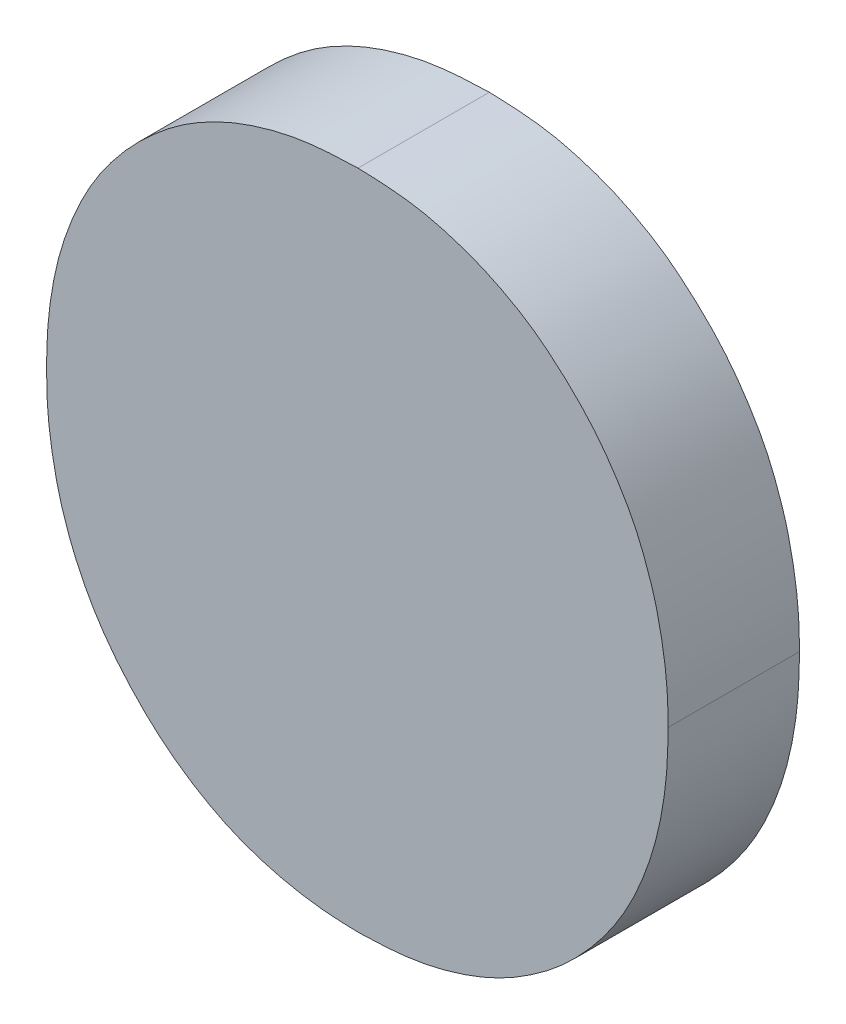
ISO-10303-21;
HEADER;
FILE_DESCRIPTION(('STEP AP214'),'2;1');
FILE_NAME('part.step','',(''),(''),'','','');
FILE_SCHEMA(('AUTOMOTIVE_DESIGN { 1 0 10303 214 1 1 1 1 }'));
ENDSEC;
DATA;
#1=APPLICATION_CONTEXT('core data for automotive mechanical design processes');
#2=APPLICATION_PROTOCOL_DEFINITION('international standard','automotive_design',2000,#1);
#3=PRODUCT_CONTEXT('',#1,'mechanical');
#4=PRODUCT('Part','Part','',(#3));
#5=PRODUCT_RELATED_PRODUCT_CATEGORY('part','',(#4));
#6=PRODUCT_DEFINITION_FORMATION('','',#4);
#7=PRODUCT_DEFINITION_CONTEXT('part definition',#1,'design');
#8=PRODUCT_DEFINITION('design','',#6,#7);
#9=PRODUCT_DEFINITION_SHAPE('','',#8);
#10=(LENGTH_UNIT() NAMED_UNIT(*) SI_UNIT(.MILLI.,.METRE.));
#11=(NAMED_UNIT(*) PLANE_ANGLE_UNIT() SI_UNIT($,.RADIAN.));
#12=(NAMED_UNIT(*) SI_UNIT($,.STERADIAN.) SOLID_ANGLE_UNIT());
#13=UNCERTAINTY_MEASURE_WITH_UNIT(LENGTH_MEASURE(1.E-05),#10,'distance_accuracy_value','');
#14=(GEOMETRIC_REPRESENTATION_CONTEXT(3) GLOBAL_UNCERTAINTY_ASSIGNED_CONTEXT((#13)) GLOBAL_UNIT_ASSIGNED_CONTEXT((#10,
#11,#12)) REPRESENTATION_CONTEXT('',''));
#15=CARTESIAN_POINT('',(0.,0.,0.));
#16=DIRECTION('',(0.,0.,1.));
#17=DIRECTION('',(1.,0.,0.));
#18=AXIS2_PLACEMENT_3D('',#15,#16,#17);
#19=CARTESIAN_POINT('',(0.,0.,0.));
#20=DIRECTION('',(0.,0.,1.));
#21=DIRECTION('',(1.,0.,0.));
#22=AXIS2_PLACEMENT_3D('',#19,#20,#21);
#23=PLANE('',#22);
#24=CARTESIAN_POINT('',(100.448005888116,202.591844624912,0.));
#25=CARTESIAN_POINT('',(100.447479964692,202.625700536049,0.));
#26=CARTESIAN_POINT('',(100.44698122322,202.659588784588,0.));
#27=CARTESIAN_POINT('',(100.445034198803,202.727310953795,0.));
#28=CARTESIAN_POINT('',(100.443586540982,202.76114489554,0.));
#29=CARTESIAN_POINT('',(100.438732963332,202.828778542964,0.));
#30=CARTESIAN_POINT('',(100.435321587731,202.862577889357,0.));
#31=CARTESIAN_POINT('',(100.42684795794,202.929969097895,0.));
#32=CARTESIAN_POINT('',(100.421785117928,202.963560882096,0.));
#33=CARTESIAN_POINT('',(100.410525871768,203.030511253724,0.));
#34=CARTESIAN_POINT('',(100.404330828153,203.063870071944,0.));
#35=CARTESIAN_POINT('',(100.390513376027,203.130284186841,0.));
#36=CARTESIAN_POINT('',(100.382891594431,203.163339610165,0.));
#37=CARTESIAN_POINT('',(100.365797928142,203.228933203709,0.));
#38=CARTESIAN_POINT('',(100.356328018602,203.261471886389,0.));
#39=CARTESIAN_POINT('',(100.335801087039,203.326055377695,0.));
#40=CARTESIAN_POINT('',(100.3247432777,203.35809993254,0.));
#41=CARTESIAN_POINT('',(100.304085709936,203.414307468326,0.));
#42=CARTESIAN_POINT('',(100.294746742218,203.43856680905,0.));
#43=CARTESIAN_POINT('',(100.275095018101,203.486677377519,0.));
#44=CARTESIAN_POINT('',(100.264782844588,203.510528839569,0.));
#45=CARTESIAN_POINT('',(100.242881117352,203.557652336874,0.));
#46=CARTESIAN_POINT('',(100.23129109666,203.580924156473,0.));
#47=CARTESIAN_POINT('',(100.206896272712,203.626829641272,0.));
#48=CARTESIAN_POINT('',(100.194090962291,203.649463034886,0.));
#49=CARTESIAN_POINT('',(100.167646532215,203.694181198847,0.));
#50=CARTESIAN_POINT('',(100.154008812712,203.716266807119,0.));
#51=CARTESIAN_POINT('',(100.126100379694,203.760031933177,0.));
#52=CARTESIAN_POINT('',(100.11182972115,203.781711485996,0.));
#53=CARTESIAN_POINT('',(100.082482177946,203.824521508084,0.));
#54=CARTESIAN_POINT('',(100.067405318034,203.845651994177,0.));
#55=CARTESIAN_POINT('',(100.036285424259,203.887187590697,0.));
#56=CARTESIAN_POINT('',(100.020242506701,203.907592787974,0.));
#57=CARTESIAN_POINT('',(99.9872391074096,203.947605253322,0.));
#58=CARTESIAN_POINT('',(99.9702797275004,203.967213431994,0.));
#59=CARTESIAN_POINT('',(99.9355341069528,204.005682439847,0.));
#60=CARTESIAN_POINT('',(99.9177478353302,204.024543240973,0.));
#61=CARTESIAN_POINT('',(99.8814361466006,204.061541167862,0.));
#62=CARTESIAN_POINT('',(99.862910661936,204.079678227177,0.));
#63=CARTESIAN_POINT('',(99.8252323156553,204.115294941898,0.));
#64=CARTESIAN_POINT('',(99.8060792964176,204.132774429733,0.));
#65=CARTESIAN_POINT('',(99.7672915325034,204.167182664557,0.));
#66=CARTESIAN_POINT('',(99.7476568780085,204.184111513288,0.));
#67=CARTESIAN_POINT('',(99.7077835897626,204.217229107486,0.));
#68=CARTESIAN_POINT('',(99.6875452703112,204.233418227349,0.));
#69=CARTESIAN_POINT('',(99.6462100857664,204.264702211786,0.));
#70=CARTESIAN_POINT('',(99.6251126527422,204.279796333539,0.));
#71=CARTESIAN_POINT('',(99.5820407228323,204.308699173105,0.));
#72=CARTESIAN_POINT('',(99.5600657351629,204.322507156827,0.));
#73=CARTESIAN_POINT('',(99.5158341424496,204.34891705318,0.));
#74=CARTESIAN_POINT('',(99.4935860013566,204.361533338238,0.));
#75=CARTESIAN_POINT('',(99.448675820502,204.386013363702,0.));
#76=CARTESIAN_POINT('',(99.4260137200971,204.39787699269,0.));
#77=CARTESIAN_POINT('',(99.3802171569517,204.420701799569,0.));
#78=CARTESIAN_POINT('',(99.3570824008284,204.4316623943,0.));
#79=CARTESIAN_POINT('',(99.3103046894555,204.452424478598,0.));
#80=CARTESIAN_POINT('',(99.2866618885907,204.462226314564,0.));
#81=CARTESIAN_POINT('',(99.2389394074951,204.480668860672,0.));
#82=CARTESIAN_POINT('',(99.2148598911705,204.489309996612,0.));
#83=CARTESIAN_POINT('',(99.1663873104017,204.505671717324,0.));
#84=CARTESIAN_POINT('',(99.1419941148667,204.513391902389,0.));
#85=CARTESIAN_POINT('',(99.0684837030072,204.535339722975,0.));
#86=CARTESIAN_POINT('',(99.0189807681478,204.548375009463,0.));
#87=CARTESIAN_POINT('',(98.9520694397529,204.562230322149,0.));
#88=CARTESIAN_POINT('',(98.9351486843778,204.565418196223,0.));
#89=CARTESIAN_POINT('',(98.9012083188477,204.571191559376,0.));
#90=CARTESIAN_POINT('',(98.8841887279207,204.57377716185,0.));
#91=CARTESIAN_POINT('',(98.8500933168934,204.578419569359,0.));
#92=CARTESIAN_POINT('',(98.8330175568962,204.580476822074,0.));
#93=CARTESIAN_POINT('',(98.7988152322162,204.584125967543,0.));
#94=CARTESIAN_POINT('',(98.7816886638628,204.585717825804,0.));
#95=CARTESIAN_POINT('',(98.7303638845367,204.589874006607,0.));
#96=CARTESIAN_POINT('',(98.6961193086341,204.591831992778,0.));
#97=CARTESIAN_POINT('',(98.6275870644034,204.594931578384,0.));
#98=CARTESIAN_POINT('',(98.5932993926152,204.59607310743,0.));
#99=CARTESIAN_POINT('',(98.559033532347,204.597208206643,0.));
#100=B_SPLINE_CURVE_WITH_KNOTS('',3,(#24,#25,#26,#27,#28,#29,#30,#31,#32,#33,#34,#35,#36,#37,
#38,#39,#40,#41,#42,#43,#44,#45,#46,#47,#48,#49,#50,#51,#52,#53,#54,#55,#56,#57,#58,#59,#60,#61,
#62,#63,#64,#65,#66,#67,#68,#69,#70,#71,#72,#73,#74,#75,#76,#77,#78,#79,#80,#81,#82,#83,#84,#85,
#86,#87,#88,#89,#90,#91,#92,#93,#94,#95,#96,#97,#98,#99),.UNSPECIFIED.,.F.,.F.,(4,2,2,2,2,2,2,2,
2,2,2,2,2,2,2,2,2,2,2,2,2,2,2,2,2,2,2,2,2,2,2,2,2,2,2,2,2,4),(0.,0.101636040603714,
0.203205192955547,0.305057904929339,0.406946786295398,0.508713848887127,0.610436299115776,
0.712050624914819,0.813715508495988,0.89168699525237,0.969612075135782,1.04756572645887,
1.12555205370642,1.20341063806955,1.28126247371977,1.35911192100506,1.43695201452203,
1.51470052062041,1.59245194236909,1.67021048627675,1.74798871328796,1.82575248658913,
1.90347645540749,1.98125266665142,2.05907300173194,2.13578537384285,2.21250907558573,
2.28928194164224,2.36603179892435,2.44275342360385,2.51950822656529,2.67284232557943,
2.72448683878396,2.77612162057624,2.8277125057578,2.87930721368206,2.98219065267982,
3.08508296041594),.UNSPECIFIED.);
#101=CARTESIAN_POINT('',(100.448005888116,202.591844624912,0.));
#102=VERTEX_POINT('',#101);
#103=CARTESIAN_POINT('',(98.559033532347,204.597208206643,0.));
#104=VERTEX_POINT('',#103);
#105=EDGE_CURVE('E24',#102,#104,#100,.T.);
#106=ORIENTED_EDGE('',*,*,#105,.F.);
#107=CARTESIAN_POINT('',(98.5647576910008,200.567400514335,0.));
#108=CARTESIAN_POINT('',(98.5988055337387,200.568475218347,0.));
#109=CARTESIAN_POINT('',(98.6328748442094,200.569558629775,0.));
#110=CARTESIAN_POINT('',(98.7010261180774,200.572569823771,0.));
#111=CARTESIAN_POINT('',(98.7351080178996,200.574498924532,0.));
#112=CARTESIAN_POINT('',(98.8032558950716,200.580039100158,0.));
#113=CARTESIAN_POINT('',(98.8373214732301,200.583655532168,0.));
#114=CARTESIAN_POINT('',(98.9051737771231,200.592805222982,0.));
#115=CARTESIAN_POINT('',(98.9389606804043,200.598337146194,0.));
#116=CARTESIAN_POINT('',(99.0058763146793,200.611459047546,0.));
#117=CARTESIAN_POINT('',(99.039008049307,200.619033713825,0.));
#118=CARTESIAN_POINT('',(99.1048145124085,200.636004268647,0.));
#119=CARTESIAN_POINT('',(99.137489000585,200.645401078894,0.));
#120=CARTESIAN_POINT('',(99.2022361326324,200.665902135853,0.));
#121=CARTESIAN_POINT('',(99.2343097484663,200.677003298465,0.));
#122=CARTESIAN_POINT('',(99.2977528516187,200.701031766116,0.));
#123=CARTESIAN_POINT('',(99.3291225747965,200.713958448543,0.));
#124=CARTESIAN_POINT('',(99.4051160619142,200.748055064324,0.));
#125=CARTESIAN_POINT('',(99.4492677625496,200.770297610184,0.));
#126=CARTESIAN_POINT('',(99.5352555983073,200.818891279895,0.));
#127=CARTESIAN_POINT('',(99.5770906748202,200.845244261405,0.));
#128=CARTESIAN_POINT('',(99.6383550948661,200.886905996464,0.));
#129=CARTESIAN_POINT('',(99.6585292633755,200.901149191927,0.));
#130=CARTESIAN_POINT('',(99.6983196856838,200.930394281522,0.));
#131=CARTESIAN_POINT('',(99.7179360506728,200.945396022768,0.));
#132=CARTESIAN_POINT('',(99.7564792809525,200.976252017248,0.));
#133=CARTESIAN_POINT('',(99.7754063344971,200.992106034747,0.));
#134=CARTESIAN_POINT('',(99.8124951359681,201.024687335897,0.));
#135=CARTESIAN_POINT('',(99.8306568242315,201.0414146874,0.));
#136=CARTESIAN_POINT('',(99.8662019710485,201.075552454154,0.));
#137=CARTESIAN_POINT('',(99.8835879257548,201.092960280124,0.));
#138=CARTESIAN_POINT('',(99.9177023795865,201.128407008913,0.));
#139=CARTESIAN_POINT('',(99.9344308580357,201.146445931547,0.));
#140=CARTESIAN_POINT('',(99.9836217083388,201.201477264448,0.));
#141=CARTESIAN_POINT('',(100.015081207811,201.239376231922,0.));
#142=CARTESIAN_POINT('',(100.074993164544,201.317461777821,0.));
#143=CARTESIAN_POINT('',(100.103446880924,201.357647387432,0.));
#144=CARTESIAN_POINT('',(100.156811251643,201.440285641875,0.));
#145=CARTESIAN_POINT('',(100.181723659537,201.482737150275,0.));
#146=CARTESIAN_POINT('',(100.229391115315,201.572284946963,0.));
#147=CARTESIAN_POINT('',(100.251911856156,201.619505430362,0.));
#148=CARTESIAN_POINT('',(100.293162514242,201.715590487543,0.));
#149=CARTESIAN_POINT('',(100.311890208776,201.764456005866,0.));
#150=CARTESIAN_POINT('',(100.345795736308,201.863506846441,0.));
#151=CARTESIAN_POINT('',(100.360966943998,201.91369444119,0.));
#152=CARTESIAN_POINT('',(100.387362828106,202.015072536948,0.));
#153=CARTESIAN_POINT('',(100.398589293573,202.066262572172,0.));
#154=CARTESIAN_POINT('',(100.415304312,202.156915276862,0.));
#155=CARTESIAN_POINT('',(100.421523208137,202.196248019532,0.));
#156=CARTESIAN_POINT('',(100.431947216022,202.275195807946,0.));
#157=CARTESIAN_POINT('',(100.436152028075,202.314810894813,0.));
#158=CARTESIAN_POINT('',(100.442227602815,202.393990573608,0.));
#159=CARTESIAN_POINT('',(100.444110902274,202.433554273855,0.));
#160=CARTESIAN_POINT('',(100.446680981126,202.512705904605,0.));
#161=CARTESIAN_POINT('',(100.447368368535,202.552293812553,0.));
#162=CARTESIAN_POINT('',(100.448005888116,202.591844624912,0.));
#163=B_SPLINE_CURVE_WITH_KNOTS('',3,(#107,#108,#109,#110,#111,#112,#113,#114,#115,#116,#117,
#118,#119,#120,#121,#122,#123,#124,#125,#126,#127,#128,#129,#130,#131,#132,#133,#134,#135,#136,
#137,#138,#139,#140,#141,#142,#143,#144,#145,#146,#147,#148,#149,#150,#151,#152,#153,#154,#155,
#156,#157,#158,#159,#160,#161,#162),.UNSPECIFIED.,.F.,.F.,(4,2,2,2,2,2,2,2,2,2,2,2,2,2,2,2,2,2,
2,2,2,2,2,2,2,2,2,4),(0.,0.10223178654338,0.204623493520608,0.307342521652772,0.409990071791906,
0.511888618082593,0.613838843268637,0.715606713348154,0.817339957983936,0.965417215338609,
1.11356158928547,1.18763932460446,1.26170218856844,1.3357446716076,1.409792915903,
1.48358257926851,1.55737456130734,1.70499301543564,1.85254938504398,2.0000324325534,
2.15679342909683,2.31364602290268,2.47078853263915,2.62785968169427,2.74728336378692,
2.86672481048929,2.98551837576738,3.10425152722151),.UNSPECIFIED.);
#164=CARTESIAN_POINT('',(98.5647576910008,200.567400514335,0.));
#165=VERTEX_POINT('',#164);
#166=EDGE_CURVE('E69',#165,#102,#163,.T.);
#167=ORIENTED_EDGE('',*,*,#166,.F.);
#168=CARTESIAN_POINT('',(96.6624289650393,202.591844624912,0.));
#169=CARTESIAN_POINT('',(96.6627530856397,202.569292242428,0.));
#170=CARTESIAN_POINT('',(96.6630802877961,202.546737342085,0.));
#171=CARTESIAN_POINT('',(96.664004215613,202.501618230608,0.));
#172=CARTESIAN_POINT('',(96.6646011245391,202.479054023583,0.));
#173=CARTESIAN_POINT('',(96.6663298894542,202.43389604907,0.));
#174=CARTESIAN_POINT('',(96.6674628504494,202.411302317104,0.));
#175=CARTESIAN_POINT('',(96.6705706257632,202.366178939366,0.));
#176=CARTESIAN_POINT('',(96.6725451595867,202.343649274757,0.));
#177=CARTESIAN_POINT('',(96.6772838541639,202.298651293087,0.));
#178=CARTESIAN_POINT('',(96.6800488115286,202.276183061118,0.));
#179=CARTESIAN_POINT('',(96.6862405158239,202.231334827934,0.));
#180=CARTESIAN_POINT('',(96.6896674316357,202.208954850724,0.));
#181=CARTESIAN_POINT('',(96.700694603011,202.142062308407,0.));
#182=CARTESIAN_POINT('',(96.7090563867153,202.097669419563,0.));
#183=CARTESIAN_POINT('',(96.7235181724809,202.031511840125,0.));
#184=CARTESIAN_POINT('',(96.7286572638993,202.00953610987,0.));
#185=CARTESIAN_POINT('',(96.7396839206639,201.965772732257,0.));
#186=CARTESIAN_POINT('',(96.7455714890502,201.943985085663,0.));
#187=CARTESIAN_POINT('',(96.7643634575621,201.878959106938,0.));
#188=CARTESIAN_POINT('',(96.7784003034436,201.836042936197,0.));
#189=CARTESIAN_POINT('',(96.8125657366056,201.742641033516,0.));
#190=CARTESIAN_POINT('',(96.8333528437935,201.692396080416,0.));
#191=CARTESIAN_POINT('',(96.8790718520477,201.593836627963,0.));
#192=CARTESIAN_POINT('',(96.9040021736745,201.545521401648,0.));
#193=CARTESIAN_POINT('',(96.944582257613,201.47489065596,0.));
#194=CARTESIAN_POINT('',(96.9586413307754,201.451651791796,0.));
#195=CARTESIAN_POINT('',(96.9878366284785,201.405861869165,0.));
#196=CARTESIAN_POINT('',(97.0029727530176,201.38331074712,0.));
#197=CARTESIAN_POINT('',(97.0342566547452,201.338900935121,0.));
#198=CARTESIAN_POINT('',(97.0504050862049,201.317042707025,0.));
#199=CARTESIAN_POINT('',(97.0836479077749,201.274058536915,0.));
#200=CARTESIAN_POINT('',(97.1007422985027,201.25293259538,0.));
#201=CARTESIAN_POINT('',(97.1357451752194,201.211423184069,0.));
#202=CARTESIAN_POINT('',(97.1536523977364,201.191038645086,0.));
#203=CARTESIAN_POINT('',(97.1901713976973,201.150907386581,0.));
#204=CARTESIAN_POINT('',(97.2087832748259,201.131160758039,0.));
#205=CARTESIAN_POINT('',(97.2466821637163,201.092338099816,0.));
#206=CARTESIAN_POINT('',(97.265968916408,201.073261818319,0.));
#207=CARTESIAN_POINT('',(97.3053578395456,201.03597876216,0.));
#208=CARTESIAN_POINT('',(97.3254597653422,201.017771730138,0.));
#209=CARTESIAN_POINT('',(97.3870916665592,200.964772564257,0.));
#210=CARTESIAN_POINT('',(97.4299910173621,200.931556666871,0.));
#211=CARTESIAN_POINT('',(97.4962564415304,200.884487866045,0.));
#212=CARTESIAN_POINT('',(97.5186715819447,200.869253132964,0.));
#213=CARTESIAN_POINT('',(97.5641207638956,200.839739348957,0.));
#214=CARTESIAN_POINT('',(97.5871547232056,200.825460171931,0.));
#215=CARTESIAN_POINT('',(97.6573492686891,200.784172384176,0.));
#216=CARTESIAN_POINT('',(97.7054927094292,200.758792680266,0.));
#217=CARTESIAN_POINT('',(97.7793982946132,200.724430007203,0.));
#218=CARTESIAN_POINT('',(97.8043153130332,200.713593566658,0.));
#219=CARTESIAN_POINT('',(97.854664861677,200.693192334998,0.));
#220=CARTESIAN_POINT('',(97.8800973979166,200.683627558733,0.));
#221=CARTESIAN_POINT('',(97.9570932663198,200.656760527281,0.));
#222=CARTESIAN_POINT('',(98.009313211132,200.641304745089,0.));
#223=CARTESIAN_POINT('',(98.0884586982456,200.621529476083,0.));
#224=CARTESIAN_POINT('',(98.1149800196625,200.615505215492,0.));
#225=CARTESIAN_POINT('',(98.1682379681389,200.6044965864,0.));
#226=CARTESIAN_POINT('',(98.1949745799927,200.599512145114,0.));
#227=CARTESIAN_POINT('',(98.2501902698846,200.59036611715,0.));
#228=CARTESIAN_POINT('',(98.2786802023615,200.586269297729,0.));
#229=CARTESIAN_POINT('',(98.3215311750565,200.581138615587,0.));
#230=CARTESIAN_POINT('',(98.335832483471,200.579597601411,0.));
#231=CARTESIAN_POINT('',(98.364469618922,200.576878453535,0.));
#232=CARTESIAN_POINT('',(98.3788054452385,200.575700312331,0.));
#233=CARTESIAN_POINT('',(98.4217060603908,200.572644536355,0.));
#234=CARTESIAN_POINT('',(98.4503017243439,200.571229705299,0.));
#235=CARTESIAN_POINT('',(98.5075225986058,200.569012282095,0.));
#236=CARTESIAN_POINT('',(98.5361478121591,200.568209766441,0.));
#237=CARTESIAN_POINT('',(98.5647576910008,200.567400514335,0.));
#238=B_SPLINE_CURVE_WITH_KNOTS('',3,(#168,#169,#170,#171,#172,#173,#174,#175,#176,#177,#178,
#179,#180,#181,#182,#183,#184,#185,#186,#187,#188,#189,#190,#191,#192,#193,#194,#195,#196,#197,
#198,#199,#200,#201,#202,#203,#204,#205,#206,#207,#208,#209,#210,#211,#212,#213,#214,#215,#216,
#217,#218,#219,#220,#221,#222,#223,#224,#225,#226,#227,#228,#229,#230,#231,#232,#233,#234,#235,
#236,#237),.UNSPECIFIED.,.F.,.F.,(4,2,2,2,2,2,2,2,2,2,2,2,2,2,2,2,2,2,2,2,2,2,2,2,2,2,2,2,2,2,2,
2,2,2,4),(0.,0.0676683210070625,0.135382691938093,0.203237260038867,0.271069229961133,
0.338969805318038,0.406887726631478,0.542338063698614,0.610033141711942,0.677728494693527,
0.813073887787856,0.976015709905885,1.13889555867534,1.22035225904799,1.30180140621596,
1.38330374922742,1.46480614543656,1.54618592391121,1.62757725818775,1.7089376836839,
1.79027386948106,1.95275841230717,2.03405123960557,2.11533331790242,2.27830216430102,
2.35978713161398,2.44127305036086,2.6043818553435,2.68595785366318,2.76752814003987,
2.8538454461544,2.89699391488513,2.94014149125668,3.02602117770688,3.11191159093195),.UNSPECIFIED.);
#239=CARTESIAN_POINT('',(96.6624289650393,202.591844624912,0.));
#240=VERTEX_POINT('',#239);
#241=EDGE_CURVE('E82',#240,#165,#238,.T.);
#242=ORIENTED_EDGE('',*,*,#241,.F.);
#243=CARTESIAN_POINT('',(98.559033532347,204.597208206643,0.));
#244=CARTESIAN_POINT('',(98.5363353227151,204.596482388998,0.));
#245=CARTESIAN_POINT('',(98.5136349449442,204.595756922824,0.));
#246=CARTESIAN_POINT('',(98.4682274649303,204.594071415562,0.));
#247=CARTESIAN_POINT('',(98.4455203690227,204.59311121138,0.));
#248=CARTESIAN_POINT('',(98.4000700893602,204.590718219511,0.));
#249=CARTESIAN_POINT('',(98.3773269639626,204.589284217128,0.));
#250=CARTESIAN_POINT('',(98.3319028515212,204.585713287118,0.));
#251=CARTESIAN_POINT('',(98.3092218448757,204.583576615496,0.));
#252=CARTESIAN_POINT('',(98.263948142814,204.578522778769,0.));
#253=CARTESIAN_POINT('',(98.2413554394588,204.575605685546,0.));
#254=CARTESIAN_POINT('',(98.1962858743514,204.568900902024,0.));
#255=CARTESIAN_POINT('',(98.1738090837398,204.565112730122,0.));
#256=CARTESIAN_POINT('',(98.1181340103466,204.554532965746,0.));
#257=CARTESIAN_POINT('',(98.0850419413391,204.547176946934,0.));
#258=CARTESIAN_POINT('',(98.0192986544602,204.53067079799,0.));
#259=CARTESIAN_POINT('',(97.9866476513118,204.521519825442,0.));
#260=CARTESIAN_POINT('',(97.9218526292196,204.501565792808,0.));
#261=CARTESIAN_POINT('',(97.8897086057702,204.490762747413,0.));
#262=CARTESIAN_POINT('',(97.8261112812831,204.467314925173,0.));
#263=CARTESIAN_POINT('',(97.7946576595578,204.45467102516,0.));
#264=CARTESIAN_POINT('',(97.7406023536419,204.431027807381,0.));
#265=CARTESIAN_POINT('',(97.7178154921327,204.420449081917,0.));
#266=CARTESIAN_POINT('',(97.6727230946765,204.398330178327,0.));
#267=CARTESIAN_POINT('',(97.6504173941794,204.386790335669,0.));
#268=CARTESIAN_POINT('',(97.6063245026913,204.362778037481,0.));
#269=CARTESIAN_POINT('',(97.5845371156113,204.350305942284,0.));
#270=CARTESIAN_POINT('',(97.5415577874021,204.324374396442,0.));
#271=CARTESIAN_POINT('',(97.5203658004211,204.310915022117,0.));
#272=CARTESIAN_POINT('',(97.4786840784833,204.282939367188,0.));
#273=CARTESIAN_POINT('',(97.4581944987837,204.268422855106,0.));
#274=CARTESIAN_POINT('',(97.4179152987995,204.238447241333,0.));
#275=CARTESIAN_POINT('',(97.3981257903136,204.222987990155,0.));
#276=CARTESIAN_POINT('',(97.3591544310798,204.191302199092,0.));
#277=CARTESIAN_POINT('',(97.3399729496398,204.175075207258,0.));
#278=CARTESIAN_POINT('',(97.3021797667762,204.141972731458,0.));
#279=CARTESIAN_POINT('',(97.2835680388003,204.125097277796,0.));
#280=CARTESIAN_POINT('',(97.2470487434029,204.09072020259,0.));
#281=CARTESIAN_POINT('',(97.2291390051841,204.07322089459,0.));
#282=CARTESIAN_POINT('',(97.1940289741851,204.037527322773,0.));
#283=CARTESIAN_POINT('',(97.1768286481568,204.019333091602,0.));
#284=CARTESIAN_POINT('',(97.1263521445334,203.963762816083,0.));
#285=CARTESIAN_POINT('',(97.0941771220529,203.925377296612,0.));
#286=CARTESIAN_POINT('',(97.0329447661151,203.846243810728,0.));
#287=CARTESIAN_POINT('',(97.0038849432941,203.805497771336,0.));
#288=CARTESIAN_POINT('',(96.9494779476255,203.721581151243,0.));
#289=CARTESIAN_POINT('',(96.9241306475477,203.678410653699,0.));
#290=CARTESIAN_POINT('',(96.8886489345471,203.611567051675,0.));
#291=CARTESIAN_POINT('',(96.8771119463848,203.588624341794,0.));
#292=CARTESIAN_POINT('',(96.8550186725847,203.542269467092,0.));
#293=CARTESIAN_POINT('',(96.8444624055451,203.518857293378,0.));
#294=CARTESIAN_POINT('',(96.8242657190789,203.471635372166,0.));
#295=CARTESIAN_POINT('',(96.8146255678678,203.447825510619,0.));
#296=CARTESIAN_POINT('',(96.7961763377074,203.399885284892,0.));
#297=CARTESIAN_POINT('',(96.7873672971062,203.375754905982,0.));
#298=CARTESIAN_POINT('',(96.7705903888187,203.327140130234,0.));
#299=CARTESIAN_POINT('',(96.7626245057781,203.302655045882,0.));
#300=CARTESIAN_POINT('',(96.7476565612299,203.253394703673,0.));
#301=CARTESIAN_POINT('',(96.7406543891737,203.228619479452,0.));
#302=CARTESIAN_POINT('',(96.7212003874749,203.153915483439,0.));
#303=CARTESIAN_POINT('',(96.7102911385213,203.103580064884,0.));
#304=CARTESIAN_POINT('',(96.6941176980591,203.014855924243,0.));
#305=CARTESIAN_POINT('',(96.6881246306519,202.976592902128,0.));
#306=CARTESIAN_POINT('',(96.678061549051,202.899795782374,0.));
#307=CARTESIAN_POINT('',(96.6739918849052,202.861261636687,0.));
#308=CARTESIAN_POINT('',(96.6681046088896,202.784250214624,0.));
#309=CARTESIAN_POINT('',(96.6662745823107,202.745773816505,0.));
#310=CARTESIAN_POINT('',(96.6637599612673,202.668801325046,0.));
#311=CARTESIAN_POINT('',(96.6630746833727,202.630305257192,0.));
#312=CARTESIAN_POINT('',(96.6624289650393,202.591844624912,0.));
#313=B_SPLINE_CURVE_WITH_KNOTS('',3,(#243,#244,#245,#246,#247,#248,#249,#250,#251,#252,#253,
#254,#255,#256,#257,#258,#259,#260,#261,#262,#263,#264,#265,#266,#267,#268,#269,#270,#271,#272,
#273,#274,#275,#276,#277,#278,#279,#280,#281,#282,#283,#284,#285,#286,#287,#288,#289,#290,#291,
#292,#293,#294,#295,#296,#297,#298,#299,#300,#301,#302,#303,#304,#305,#306,#307,#308,#309,#310,
#311,#312),.UNSPECIFIED.,.F.,.F.,(4,2,2,2,2,2,2,2,2,2,2,2,2,2,2,2,2,2,2,2,2,2,2,2,2,2,2,2,2,2,2,
2,2,2,4),(0.,0.0681330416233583,0.13631355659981,0.204670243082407,0.273002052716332,
0.341327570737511,0.409690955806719,0.511327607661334,0.613012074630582,0.714695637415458,
0.816330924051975,0.891676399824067,0.966995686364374,1.04228600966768,1.11757051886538,
1.19287156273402,1.26818457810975,1.34354249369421,1.41889689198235,1.49399615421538,
1.56909189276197,1.71918769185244,1.86916264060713,2.0191324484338,2.09615403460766,
2.17317708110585,2.25022260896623,2.32727169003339,2.40449827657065,2.4817159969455,
2.63606168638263,2.75221695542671,2.86839335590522,2.98392280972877,3.09938326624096),.UNSPECIFIED.);
#314=EDGE_CURVE('E70',#104,#240,#313,.T.);
#315=ORIENTED_EDGE('',*,*,#314,.F.);
#316=EDGE_LOOP('',(#106,#167,#242,#315));
#317=FACE_BOUND('',#316,.T.);
#318=ADVANCED_FACE('F17',(#317),#23,.F.);
#319=CARTESIAN_POINT('',(98.559033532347,204.597208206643,0.800000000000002));
#320=CARTESIAN_POINT('',(98.559033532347,204.597208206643,0.));
#321=CARTESIAN_POINT('',(98.6252251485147,204.595008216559,0.800000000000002));
#322=CARTESIAN_POINT('',(98.6252251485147,204.595008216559,0.));
#323=CARTESIAN_POINT('',(98.755524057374,204.590677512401,0.800000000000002));
#324=CARTESIAN_POINT('',(98.755524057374,204.590677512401,0.));
#325=CARTESIAN_POINT('',(98.947327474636,204.567435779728,0.800000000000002));
#326=CARTESIAN_POINT('',(98.947327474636,204.567435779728,0.));
#327=CARTESIAN_POINT('',(99.1287371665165,204.519799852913,0.800000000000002));
#328=CARTESIAN_POINT('',(99.1287371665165,204.519799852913,0.));
#329=CARTESIAN_POINT('',(99.303356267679,204.459219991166,0.800000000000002));
#330=CARTESIAN_POINT('',(99.303356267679,204.459219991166,0.));
#331=CARTESIAN_POINT('',(99.4680957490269,204.378202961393,0.800000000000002));
#332=CARTESIAN_POINT('',(99.4680957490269,204.378202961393,0.));
#333=CARTESIAN_POINT('',(99.6274672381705,204.283394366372,0.800000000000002));
#334=CARTESIAN_POINT('',(99.6274672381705,204.283394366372,0.));
#335=CARTESIAN_POINT('',(99.773183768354,204.164753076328,0.800000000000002));
#336=CARTESIAN_POINT('',(99.773183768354,204.164753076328,0.));
#337=CARTESIAN_POINT('',(99.9122970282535,204.034612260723,0.800000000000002));
#338=CARTESIAN_POINT('',(99.9122970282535,204.034612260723,0.));
#339=CARTESIAN_POINT('',(100.038580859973,203.89009437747,0.800000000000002));
#340=CARTESIAN_POINT('',(100.038580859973,203.89009437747,0.));
#341=CARTESIAN_POINT('',(100.146186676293,203.732642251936,0.800000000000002));
#342=CARTESIAN_POINT('',(100.146186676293,203.732642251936,0.));
#343=CARTESIAN_POINT('',(100.242334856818,203.568279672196,0.800000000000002));
#344=CARTESIAN_POINT('',(100.242334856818,203.568279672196,0.));
#345=CARTESIAN_POINT('',(100.315239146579,203.390989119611,0.800000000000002));
#346=CARTESIAN_POINT('',(100.315239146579,203.390989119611,0.));
#347=CARTESIAN_POINT('',(100.375574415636,203.205616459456,0.800000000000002));
#348=CARTESIAN_POINT('',(100.375574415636,203.205616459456,0.));
#349=CARTESIAN_POINT('',(100.416408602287,203.009166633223,0.800000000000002));
#350=CARTESIAN_POINT('',(100.416408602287,203.009166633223,0.));
#351=CARTESIAN_POINT('',(100.444826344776,202.803834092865,0.800000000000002));
#352=CARTESIAN_POINT('',(100.444826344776,202.803834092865,0.));
#353=CARTESIAN_POINT('',(100.44693595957,202.663179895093,0.800000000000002));
#354=CARTESIAN_POINT('',(100.44693595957,202.663179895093,0.));
#355=CARTESIAN_POINT('',(100.448005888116,202.591844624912,0.800000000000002));
#356=CARTESIAN_POINT('',(100.448005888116,202.591844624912,0.));
#357=B_SPLINE_SURFACE_WITH_KNOTS('',3,1,((#319,#320),(#321,#322),(#323,#324),(#325,#326),(#327,
#328),(#329,#330),(#331,#332),(#333,#334),(#335,#336),(#337,#338),(#339,#340),(#341,#342),(#343,
#344),(#345,#346),(#347,#348),(#349,#350),(#351,#352),(#353,#354),(#355,#356)),.UNSPECIFIED.,
.F.,.F.,.F.,(4,1,1,1,1,1,1,1,1,1,1,1,1,1,1,1,4),(2,2),(0.,0.0644156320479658,0.12680286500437,
0.187422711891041,0.24651750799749,0.30628530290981,0.36570305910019,0.426477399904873,
0.488621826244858,0.550895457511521,0.612678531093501,0.673914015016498,0.735734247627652,
0.79873503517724,0.863290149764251,0.930665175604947,1.),(0.,1.),.UNSPECIFIED.);
#358=DIRECTION('',(0.,0.,-1.));
#359=VECTOR('',#358,1.);
#360=CARTESIAN_POINT('',(98.559033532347,204.597208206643,0.400000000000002));
#361=LINE('',#360,#359);
#362=CARTESIAN_POINT('',(98.559033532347,204.597208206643,0.800000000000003));
#363=VERTEX_POINT('',#362);
#364=EDGE_CURVE('E73',#363,#104,#361,.T.);
#365=CARTESIAN_POINT('',(100.448005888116,202.591844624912,0.800000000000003));
#366=CARTESIAN_POINT('',(100.447479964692,202.625700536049,0.800000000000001));
#367=CARTESIAN_POINT('',(100.44698122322,202.659588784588,0.8));
#368=CARTESIAN_POINT('',(100.445034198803,202.727310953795,0.8));
#369=CARTESIAN_POINT('',(100.443586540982,202.76114489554,0.8));
#370=CARTESIAN_POINT('',(100.438732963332,202.828778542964,0.8));
#371=CARTESIAN_POINT('',(100.435321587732,202.862577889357,0.8));
#372=CARTESIAN_POINT('',(100.42684795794,202.929969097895,0.8));
#373=CARTESIAN_POINT('',(100.421785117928,202.963560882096,0.8));
#374=CARTESIAN_POINT('',(100.410525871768,203.030511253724,0.8));
#375=CARTESIAN_POINT('',(100.404330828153,203.063870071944,0.8));
#376=CARTESIAN_POINT('',(100.390513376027,203.130284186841,0.8));
#377=CARTESIAN_POINT('',(100.382891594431,203.163339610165,0.8));
#378=CARTESIAN_POINT('',(100.365797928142,203.228933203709,0.8));
#379=CARTESIAN_POINT('',(100.356328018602,203.261471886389,0.799999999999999));
#380=CARTESIAN_POINT('',(100.335801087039,203.326055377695,0.800000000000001));
#381=CARTESIAN_POINT('',(100.3247432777,203.35809993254,0.800000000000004));
#382=CARTESIAN_POINT('',(100.304085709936,203.414307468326,0.800000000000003));
#383=CARTESIAN_POINT('',(100.294746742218,203.43856680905,0.800000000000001));
#384=CARTESIAN_POINT('',(100.275095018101,203.486677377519,0.799999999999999));
#385=CARTESIAN_POINT('',(100.264782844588,203.510528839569,0.8));
#386=CARTESIAN_POINT('',(100.242881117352,203.557652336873,0.8));
#387=CARTESIAN_POINT('',(100.23129109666,203.580924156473,0.8));
#388=CARTESIAN_POINT('',(100.206896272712,203.626829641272,0.8));
#389=CARTESIAN_POINT('',(100.194090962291,203.649463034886,0.8));
#390=CARTESIAN_POINT('',(100.167646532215,203.694181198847,0.8));
#391=CARTESIAN_POINT('',(100.154008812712,203.716266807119,0.8));
#392=CARTESIAN_POINT('',(100.126100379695,203.760031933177,0.8));
#393=CARTESIAN_POINT('',(100.11182972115,203.781711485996,0.8));
#394=CARTESIAN_POINT('',(100.082482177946,203.824521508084,0.8));
#395=CARTESIAN_POINT('',(100.067405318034,203.845651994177,0.799999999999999));
#396=CARTESIAN_POINT('',(100.036285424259,203.887187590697,0.800000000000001));
#397=CARTESIAN_POINT('',(100.020242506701,203.907592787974,0.800000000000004));
#398=CARTESIAN_POINT('',(99.9872391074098,203.947605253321,0.800000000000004));
#399=CARTESIAN_POINT('',(99.9702797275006,203.967213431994,0.800000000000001));
#400=CARTESIAN_POINT('',(99.9355341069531,204.005682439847,0.799999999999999));
#401=CARTESIAN_POINT('',(99.9177478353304,204.024543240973,0.8));
#402=CARTESIAN_POINT('',(99.8814361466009,204.061541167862,0.8));
#403=CARTESIAN_POINT('',(99.8629106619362,204.079678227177,0.8));
#404=CARTESIAN_POINT('',(99.8252323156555,204.115294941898,0.8));
#405=CARTESIAN_POINT('',(99.8060792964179,204.132774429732,0.8));
#406=CARTESIAN_POINT('',(99.7672915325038,204.167182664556,0.8));
#407=CARTESIAN_POINT('',(99.7476568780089,204.184111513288,0.8));
#408=CARTESIAN_POINT('',(99.707783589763,204.217229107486,0.8));
#409=CARTESIAN_POINT('',(99.6875452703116,204.233418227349,0.8));
#410=CARTESIAN_POINT('',(99.6462100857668,204.264702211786,0.8));
#411=CARTESIAN_POINT('',(99.6251126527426,204.279796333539,0.799999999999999));
#412=CARTESIAN_POINT('',(99.5820407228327,204.308699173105,0.800000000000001));
#413=CARTESIAN_POINT('',(99.5600657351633,204.322507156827,0.800000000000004));
#414=CARTESIAN_POINT('',(99.5158341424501,204.34891705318,0.800000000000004));
#415=CARTESIAN_POINT('',(99.4935860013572,204.361533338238,0.800000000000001));
#416=CARTESIAN_POINT('',(99.4486758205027,204.386013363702,0.799999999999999));
#417=CARTESIAN_POINT('',(99.4260137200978,204.39787699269,0.8));
#418=CARTESIAN_POINT('',(99.3802171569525,204.420701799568,0.8));
#419=CARTESIAN_POINT('',(99.3570824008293,204.431662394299,0.8));
#420=CARTESIAN_POINT('',(99.3103046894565,204.452424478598,0.8));
#421=CARTESIAN_POINT('',(99.2866618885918,204.462226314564,0.8));
#422=CARTESIAN_POINT('',(99.2389394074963,204.480668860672,0.8));
#423=CARTESIAN_POINT('',(99.2148598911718,204.489309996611,0.8));
#424=CARTESIAN_POINT('',(99.1663873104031,204.505671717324,0.8));
#425=CARTESIAN_POINT('',(99.1419941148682,204.513391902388,0.799999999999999));
#426=CARTESIAN_POINT('',(99.0684837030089,204.535339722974,0.800000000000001));
#427=CARTESIAN_POINT('',(99.0189807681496,204.548375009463,0.800000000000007));
#428=CARTESIAN_POINT('',(98.9520694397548,204.562230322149,0.800000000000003));
#429=CARTESIAN_POINT('',(98.9351486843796,204.565418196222,0.800000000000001));
#430=CARTESIAN_POINT('',(98.9012083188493,204.571191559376,0.799999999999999));
#431=CARTESIAN_POINT('',(98.8841887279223,204.57377716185,0.8));
#432=CARTESIAN_POINT('',(98.8500933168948,204.578419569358,0.8));
#433=CARTESIAN_POINT('',(98.8330175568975,204.580476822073,0.8));
#434=CARTESIAN_POINT('',(98.7988152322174,204.584125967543,0.8));
#435=CARTESIAN_POINT('',(98.7816886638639,204.585717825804,0.8));
#436=CARTESIAN_POINT('',(98.7303638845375,204.589874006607,0.8));
#437=CARTESIAN_POINT('',(98.6961193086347,204.591831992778,0.8));
#438=CARTESIAN_POINT('',(98.6275870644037,204.594931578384,0.8));
#439=CARTESIAN_POINT('',(98.5932993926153,204.59607310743,0.800000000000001));
#440=CARTESIAN_POINT('',(98.559033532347,204.597208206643,0.800000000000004));
#441=B_SPLINE_CURVE_WITH_KNOTS('',3,(#365,#366,#367,#368,#369,#370,#371,#372,#373,#374,#375,
#376,#377,#378,#379,#380,#381,#382,#383,#384,#385,#386,#387,#388,#389,#390,#391,#392,#393,#394,
#395,#396,#397,#398,#399,#400,#401,#402,#403,#404,#405,#406,#407,#408,#409,#410,#411,#412,#413,
#414,#415,#416,#417,#418,#419,#420,#421,#422,#423,#424,#425,#426,#427,#428,#429,#430,#431,#432,
#433,#434,#435,#436,#437,#438,#439,#440),.UNSPECIFIED.,.F.,.F.,(4,2,2,2,2,2,2,2,2,2,2,2,2,2,2,2,
2,2,2,2,2,2,2,2,2,2,2,2,2,2,2,2,2,2,2,2,2,4),(0.,0.101636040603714,0.203205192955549,
0.305057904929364,0.406946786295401,0.508713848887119,0.610436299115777,0.712050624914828,
0.813715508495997,0.891686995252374,0.969612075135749,1.04756572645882,1.12555205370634,
1.2034106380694,1.28126247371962,1.35911192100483,1.43695201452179,1.51470052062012,
1.59245194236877,1.67021048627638,1.74798871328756,1.82575248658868,1.90347645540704,
1.98125266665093,2.05907300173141,2.13578537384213,2.21250907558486,2.28928194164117,
2.3660317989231,2.44275342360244,2.5195082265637,2.67284232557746,2.72448683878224,
2.77612162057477,2.82771250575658,2.87930721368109,2.98219065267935,3.08508296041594),.UNSPECIFIED.);
#442=CARTESIAN_POINT('',(100.448005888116,202.591844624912,0.800000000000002));
#443=VERTEX_POINT('',#442);
#444=EDGE_CURVE('E78',#443,#363,#441,.T.);
#445=DIRECTION('',(0.,0.,1.));
#446=VECTOR('',#445,1.);
#447=CARTESIAN_POINT('',(100.448005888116,202.591844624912,0.400000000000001));
#448=LINE('',#447,#446);
#449=EDGE_CURVE('E75',#102,#443,#448,.T.);
#450=ORIENTED_EDGE('',*,*,#364,.F.);
#451=ORIENTED_EDGE('',*,*,#444,.F.);
#452=ORIENTED_EDGE('',*,*,#449,.F.);
#453=ORIENTED_EDGE('',*,*,#105,.T.);
#454=EDGE_LOOP('',(#450,#451,#452,#453));
#455=FACE_BOUND('',#454,.T.);
#456=ADVANCED_FACE('F76',(#455),#357,.T.);
#457=CARTESIAN_POINT('',(96.6624289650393,202.591844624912,0.800000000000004));
#458=CARTESIAN_POINT('',(96.6624289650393,202.591844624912,0.));
#459=CARTESIAN_POINT('',(96.6636968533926,202.664424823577,0.800000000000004));
#460=CARTESIAN_POINT('',(96.6636968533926,202.664424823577,0.));
#461=CARTESIAN_POINT('',(96.6661848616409,202.806850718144,0.800000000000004));
#462=CARTESIAN_POINT('',(96.6661848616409,202.806850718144,0.));
#463=CARTESIAN_POINT('',(96.6915229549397,203.015031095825,0.800000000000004));
#464=CARTESIAN_POINT('',(96.6915229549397,203.015031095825,0.));
#465=CARTESIAN_POINT('',(96.7328933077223,203.212617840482,0.800000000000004));
#466=CARTESIAN_POINT('',(96.7328933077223,203.212617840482,0.));
#467=CARTESIAN_POINT('',(96.7930156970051,203.398767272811,0.800000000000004));
#468=CARTESIAN_POINT('',(96.7930156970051,203.398767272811,0.));
#469=CARTESIAN_POINT('',(96.8672232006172,203.575603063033,0.800000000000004));
#470=CARTESIAN_POINT('',(96.8672232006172,203.575603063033,0.));
#471=CARTESIAN_POINT('',(96.9588748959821,203.742220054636,0.800000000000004));
#472=CARTESIAN_POINT('',(96.9588748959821,203.742220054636,0.));
#473=CARTESIAN_POINT('',(97.0689070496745,203.897797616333,0.800000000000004));
#474=CARTESIAN_POINT('',(97.0689070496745,203.897797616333,0.));
#475=CARTESIAN_POINT('',(97.1936480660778,204.041564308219,0.800000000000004));
#476=CARTESIAN_POINT('',(97.1936480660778,204.041564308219,0.));
#477=CARTESIAN_POINT('',(97.3316109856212,204.17123421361,0.800000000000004));
#478=CARTESIAN_POINT('',(97.3316109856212,204.17123421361,0.));
#479=CARTESIAN_POINT('',(97.4779614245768,204.286868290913,0.800000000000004));
#480=CARTESIAN_POINT('',(97.4779614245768,204.286868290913,0.));
#481=CARTESIAN_POINT('',(97.6360459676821,204.382506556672,0.800000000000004));
#482=CARTESIAN_POINT('',(97.6360459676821,204.382506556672,0.));
#483=CARTESIAN_POINT('',(97.8028988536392,204.461346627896,0.800000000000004));
#484=CARTESIAN_POINT('',(97.8028988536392,204.461346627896,0.));
#485=CARTESIAN_POINT('',(97.9789639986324,204.522002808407,0.800000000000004));
#486=CARTESIAN_POINT('',(97.9789639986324,204.522002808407,0.));
#487=CARTESIAN_POINT('',(98.164043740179,204.567027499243,0.800000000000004));
#488=CARTESIAN_POINT('',(98.164043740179,204.567027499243,0.));
#489=CARTESIAN_POINT('',(98.358705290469,204.590804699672,0.800000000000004));
#490=CARTESIAN_POINT('',(98.358705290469,204.590804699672,0.));
#491=CARTESIAN_POINT('',(98.4915595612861,204.5950513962,0.800000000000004));
#492=CARTESIAN_POINT('',(98.4915595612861,204.5950513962,0.));
#493=CARTESIAN_POINT('',(98.559033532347,204.597208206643,0.800000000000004));
#494=CARTESIAN_POINT('',(98.559033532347,204.597208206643,0.));
#495=B_SPLINE_SURFACE_WITH_KNOTS('',3,1,((#457,#458),(#459,#460),(#461,#462),(#463,#464),(#465,
#466),(#467,#468),(#469,#470),(#471,#472),(#473,#474),(#475,#476),(#477,#478),(#479,#480),(#481,
#482),(#483,#484),(#485,#486),(#487,#488),(#489,#490),(#491,#492),(#493,#494)),.UNSPECIFIED.,
.F.,.F.,.F.,(4,1,1,1,1,1,1,1,1,1,1,1,1,1,1,1,4),(2,2),(0.,0.0702434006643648,0.137840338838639,
0.202697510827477,0.265405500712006,0.326938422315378,0.38812526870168,0.44911658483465,
0.51110079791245,0.572085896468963,0.632197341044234,0.691338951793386,0.750563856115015,
0.810545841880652,0.871334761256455,0.934653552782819,1.),(0.,1.),.UNSPECIFIED.);
#496=DIRECTION('',(0.,0.,-1.));
#497=VECTOR('',#496,1.);
#498=CARTESIAN_POINT('',(96.6624289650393,202.591844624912,0.4));
#499=LINE('',#498,#497);
#500=CARTESIAN_POINT('',(96.6624289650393,202.591844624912,0.8));
#501=VERTEX_POINT('',#500);
#502=EDGE_CURVE('E115',#501,#240,#499,.T.);
#503=CARTESIAN_POINT('',(98.559033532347,204.597208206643,0.800000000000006));
#504=CARTESIAN_POINT('',(98.5363353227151,204.596482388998,0.800000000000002));
#505=CARTESIAN_POINT('',(98.5136349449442,204.595756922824,0.800000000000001));
#506=CARTESIAN_POINT('',(98.4682274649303,204.594071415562,0.799999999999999));
#507=CARTESIAN_POINT('',(98.4455203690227,204.59311121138,0.8));
#508=CARTESIAN_POINT('',(98.4000700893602,204.590718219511,0.8));
#509=CARTESIAN_POINT('',(98.3773269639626,204.589284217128,0.8));
#510=CARTESIAN_POINT('',(98.3319028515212,204.585713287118,0.8));
#511=CARTESIAN_POINT('',(98.3092218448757,204.583576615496,0.8));
#512=CARTESIAN_POINT('',(98.263948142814,204.578522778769,0.8));
#513=CARTESIAN_POINT('',(98.2413554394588,204.575605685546,0.8));
#514=CARTESIAN_POINT('',(98.1962858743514,204.568900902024,0.8));
#515=CARTESIAN_POINT('',(98.1738090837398,204.565112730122,0.8));
#516=CARTESIAN_POINT('',(98.1181340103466,204.554532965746,0.8));
#517=CARTESIAN_POINT('',(98.0850419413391,204.547176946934,0.8));
#518=CARTESIAN_POINT('',(98.0192986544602,204.53067079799,0.8));
#519=CARTESIAN_POINT('',(97.9866476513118,204.521519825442,0.800000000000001));
#520=CARTESIAN_POINT('',(97.9218526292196,204.501565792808,0.799999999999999));
#521=CARTESIAN_POINT('',(97.8897086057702,204.490762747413,0.799999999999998));
#522=CARTESIAN_POINT('',(97.8261112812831,204.467314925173,0.800000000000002));
#523=CARTESIAN_POINT('',(97.7946576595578,204.45467102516,0.800000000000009));
#524=CARTESIAN_POINT('',(97.7406023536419,204.431027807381,0.800000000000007));
#525=CARTESIAN_POINT('',(97.7178154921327,204.420449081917,0.800000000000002));
#526=CARTESIAN_POINT('',(97.6727230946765,204.398330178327,0.799999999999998));
#527=CARTESIAN_POINT('',(97.6504173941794,204.386790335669,0.8));
#528=CARTESIAN_POINT('',(97.6063245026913,204.362778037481,0.8));
#529=CARTESIAN_POINT('',(97.5845371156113,204.350305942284,0.8));
#530=CARTESIAN_POINT('',(97.5415577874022,204.324374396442,0.8));
#531=CARTESIAN_POINT('',(97.5203658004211,204.310915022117,0.8));
#532=CARTESIAN_POINT('',(97.4786840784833,204.282939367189,0.8));
#533=CARTESIAN_POINT('',(97.4581944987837,204.268422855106,0.8));
#534=CARTESIAN_POINT('',(97.4179152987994,204.238447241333,0.8));
#535=CARTESIAN_POINT('',(97.3981257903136,204.222987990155,0.800000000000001));
#536=CARTESIAN_POINT('',(97.3591544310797,204.191302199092,0.799999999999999));
#537=CARTESIAN_POINT('',(97.3399729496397,204.175075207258,0.799999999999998));
#538=CARTESIAN_POINT('',(97.3021797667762,204.141972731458,0.800000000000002));
#539=CARTESIAN_POINT('',(97.2835680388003,204.125097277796,0.800000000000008));
#540=CARTESIAN_POINT('',(97.2470487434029,204.09072020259,0.800000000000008));
#541=CARTESIAN_POINT('',(97.2291390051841,204.07322089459,0.800000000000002));
#542=CARTESIAN_POINT('',(97.1940289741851,204.037527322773,0.799999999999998));
#543=CARTESIAN_POINT('',(97.1768286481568,204.019333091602,0.799999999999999));
#544=CARTESIAN_POINT('',(97.1263521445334,203.963762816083,0.800000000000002));
#545=CARTESIAN_POINT('',(97.0941771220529,203.925377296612,0.800000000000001));
#546=CARTESIAN_POINT('',(97.0329447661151,203.846243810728,0.799999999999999));
#547=CARTESIAN_POINT('',(97.003884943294,203.805497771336,0.799999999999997));
#548=CARTESIAN_POINT('',(96.9494779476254,203.721581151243,0.800000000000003));
#549=CARTESIAN_POINT('',(96.9241306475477,203.678410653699,0.800000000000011));
#550=CARTESIAN_POINT('',(96.8886489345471,203.611567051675,0.800000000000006));
#551=CARTESIAN_POINT('',(96.8771119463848,203.588624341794,0.800000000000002));
#552=CARTESIAN_POINT('',(96.8550186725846,203.542269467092,0.799999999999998));
#553=CARTESIAN_POINT('',(96.844462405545,203.518857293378,0.8));
#554=CARTESIAN_POINT('',(96.8242657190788,203.471635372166,0.8));
#555=CARTESIAN_POINT('',(96.8146255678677,203.447825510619,0.8));
#556=CARTESIAN_POINT('',(96.7961763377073,203.399885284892,0.8));
#557=CARTESIAN_POINT('',(96.7873672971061,203.375754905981,0.8));
#558=CARTESIAN_POINT('',(96.7705903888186,203.327140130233,0.8));
#559=CARTESIAN_POINT('',(96.762624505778,203.302655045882,0.8));
#560=CARTESIAN_POINT('',(96.7476565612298,203.253394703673,0.8));
#561=CARTESIAN_POINT('',(96.7406543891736,203.228619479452,0.799999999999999));
#562=CARTESIAN_POINT('',(96.7212003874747,203.153915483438,0.800000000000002));
#563=CARTESIAN_POINT('',(96.7102911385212,203.103580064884,0.800000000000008));
#564=CARTESIAN_POINT('',(96.694117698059,203.014855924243,0.800000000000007));
#565=CARTESIAN_POINT('',(96.6881246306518,202.976592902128,0.800000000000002));
#566=CARTESIAN_POINT('',(96.6780615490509,202.899795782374,0.799999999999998));
#567=CARTESIAN_POINT('',(96.6739918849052,202.861261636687,0.8));
#568=CARTESIAN_POINT('',(96.6681046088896,202.784250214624,0.8));
#569=CARTESIAN_POINT('',(96.6662745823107,202.745773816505,0.8));
#570=CARTESIAN_POINT('',(96.6637599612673,202.668801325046,0.8));
#571=CARTESIAN_POINT('',(96.6630746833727,202.630305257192,0.800000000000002));
#572=CARTESIAN_POINT('',(96.6624289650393,202.591844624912,0.800000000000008));
#573=B_SPLINE_CURVE_WITH_KNOTS('',3,(#503,#504,#505,#506,#507,#508,#509,#510,#511,#512,#513,
#514,#515,#516,#517,#518,#519,#520,#521,#522,#523,#524,#525,#526,#527,#528,#529,#530,#531,#532,
#533,#534,#535,#536,#537,#538,#539,#540,#541,#542,#543,#544,#545,#546,#547,#548,#549,#550,#551,
#552,#553,#554,#555,#556,#557,#558,#559,#560,#561,#562,#563,#564,#565,#566,#567,#568,#569,#570,
#571,#572),.UNSPECIFIED.,.F.,.F.,(4,2,2,2,2,2,2,2,2,2,2,2,2,2,2,2,2,2,2,2,2,2,2,2,2,2,2,2,2,2,2,
2,2,2,4),(0.,0.0681330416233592,0.136313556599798,0.20467024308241,0.273002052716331,
0.341327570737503,0.409690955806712,0.511327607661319,0.613012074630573,0.714695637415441,
0.816330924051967,0.89167639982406,0.96699568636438,1.04228600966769,1.11757051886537,
1.19287156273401,1.26818457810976,1.34354249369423,1.41889689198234,1.49399615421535,
1.56909189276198,1.71918769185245,1.86916264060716,2.01913244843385,2.09615403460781,
2.17317708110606,2.25022260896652,2.32727169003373,2.40449827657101,2.48171599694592,
2.63606168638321,2.75221695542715,2.86839335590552,2.98392280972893,3.09938326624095),.UNSPECIFIED.);
#574=EDGE_CURVE('E132',#363,#501,#573,.T.);
#575=ORIENTED_EDGE('',*,*,#502,.F.);
#576=ORIENTED_EDGE('',*,*,#574,.F.);
#577=ORIENTED_EDGE('',*,*,#364,.T.);
#578=ORIENTED_EDGE('',*,*,#314,.T.);
#579=EDGE_LOOP('',(#575,#576,#577,#578));
#580=FACE_BOUND('',#579,.T.);
#581=ADVANCED_FACE('F116',(#580),#495,.T.);
#582=CARTESIAN_POINT('',(98.5647576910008,200.567400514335,0.8));
#583=CARTESIAN_POINT('',(98.5647576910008,200.567400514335,0.));
#584=CARTESIAN_POINT('',(98.497880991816,200.569281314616,0.8));
#585=CARTESIAN_POINT('',(98.497880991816,200.569281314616,0.));
#586=CARTESIAN_POINT('',(98.3667638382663,200.572968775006,0.8));
#587=CARTESIAN_POINT('',(98.3667638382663,200.572968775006,0.));
#588=CARTESIAN_POINT('',(98.1744607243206,200.600582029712,0.8));
#589=CARTESIAN_POINT('',(98.1744607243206,200.600582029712,0.));
#590=CARTESIAN_POINT('',(97.9909308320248,200.6440398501,0.8));
#591=CARTESIAN_POINT('',(97.9909308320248,200.6440398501,0.));
#592=CARTESIAN_POINT('',(97.8153672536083,200.70537130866,0.8));
#593=CARTESIAN_POINT('',(97.8153672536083,200.70537130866,0.));
#594=CARTESIAN_POINT('',(97.6491894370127,200.785815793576,0.8));
#595=CARTESIAN_POINT('',(97.6491894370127,200.785815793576,0.));
#596=CARTESIAN_POINT('',(97.4917612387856,200.884346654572,0.8));
#597=CARTESIAN_POINT('',(97.4917612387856,200.884346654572,0.));
#598=CARTESIAN_POINT('',(97.3416977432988,200.998778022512,0.8));
#599=CARTESIAN_POINT('',(97.3416977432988,200.998778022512,0.));
#600=CARTESIAN_POINT('',(97.2039482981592,201.132774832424,0.8));
#601=CARTESIAN_POINT('',(97.2039482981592,201.132774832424,0.));
#602=CARTESIAN_POINT('',(97.0764362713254,201.278113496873,0.8));
#603=CARTESIAN_POINT('',(97.0764362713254,201.278113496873,0.));
#604=CARTESIAN_POINT('',(96.9646158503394,201.435741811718,0.8));
#605=CARTESIAN_POINT('',(96.9646158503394,201.435741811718,0.));
#606=CARTESIAN_POINT('',(96.871174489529,201.604263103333,0.8));
#607=CARTESIAN_POINT('',(96.871174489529,201.604263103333,0.));
#608=CARTESIAN_POINT('',(96.7945358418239,201.782617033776,0.8));
#609=CARTESIAN_POINT('',(96.7945358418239,201.782617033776,0.));
#610=CARTESIAN_POINT('',(96.7350626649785,201.970558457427,0.8));
#611=CARTESIAN_POINT('',(96.7350626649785,201.970558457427,0.));
#612=CARTESIAN_POINT('',(96.6939739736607,202.168785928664,0.8));
#613=CARTESIAN_POINT('',(96.6939739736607,202.168785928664,0.));
#614=CARTESIAN_POINT('',(96.6655410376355,202.376685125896,0.8));
#615=CARTESIAN_POINT('',(96.6655410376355,202.376685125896,0.));
#616=CARTESIAN_POINT('',(96.6634791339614,202.519239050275,0.8));
#617=CARTESIAN_POINT('',(96.6634791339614,202.519239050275,0.));
#618=CARTESIAN_POINT('',(96.6624289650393,202.591844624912,0.8));
#619=CARTESIAN_POINT('',(96.6624289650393,202.591844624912,0.));
#620=B_SPLINE_SURFACE_WITH_KNOTS('',3,1,((#582,#583),(#584,#585),(#586,#587),(#588,#589),(#590,
#591),(#592,#593),(#594,#595),(#596,#597),(#598,#599),(#600,#601),(#602,#603),(#604,#605),(#606,
#607),(#608,#609),(#610,#611),(#612,#613),(#614,#615),(#616,#617),(#618,#619)),.UNSPECIFIED.,
.F.,.F.,.F.,(4,1,1,1,1,1,1,1,1,1,1,1,1,1,1,1,4),(2,2),(0.,0.0644690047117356,0.126396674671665,
0.186939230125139,0.246099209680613,0.305348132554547,0.364571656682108,0.424924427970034,
0.486952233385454,0.549550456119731,0.611149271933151,0.672921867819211,0.735010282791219,
0.798048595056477,0.862642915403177,0.930041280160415,1.),(0.,1.),.UNSPECIFIED.);
#621=DIRECTION('',(0.,0.,-1.));
#622=VECTOR('',#621,1.);
#623=CARTESIAN_POINT('',(98.5647576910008,200.567400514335,0.400000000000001));
#624=LINE('',#623,#622);
#625=CARTESIAN_POINT('',(98.5647576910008,200.567400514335,0.8));
#626=VERTEX_POINT('',#625);
#627=EDGE_CURVE('E45',#626,#165,#624,.T.);
#628=CARTESIAN_POINT('',(96.6624289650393,202.591844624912,0.800000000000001));
#629=CARTESIAN_POINT('',(96.6627530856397,202.569292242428,0.8));
#630=CARTESIAN_POINT('',(96.6630802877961,202.546737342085,0.8));
#631=CARTESIAN_POINT('',(96.664004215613,202.501618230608,0.8));
#632=CARTESIAN_POINT('',(96.6646011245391,202.479054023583,0.8));
#633=CARTESIAN_POINT('',(96.6663298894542,202.43389604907,0.8));
#634=CARTESIAN_POINT('',(96.6674628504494,202.411302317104,0.8));
#635=CARTESIAN_POINT('',(96.6705706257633,202.366178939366,0.8));
#636=CARTESIAN_POINT('',(96.6725451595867,202.343649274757,0.8));
#637=CARTESIAN_POINT('',(96.6772838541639,202.298651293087,0.8));
#638=CARTESIAN_POINT('',(96.6800488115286,202.276183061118,0.8));
#639=CARTESIAN_POINT('',(96.6862405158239,202.231334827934,0.8));
#640=CARTESIAN_POINT('',(96.6896674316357,202.208954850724,0.8));
#641=CARTESIAN_POINT('',(96.700694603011,202.142062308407,0.8));
#642=CARTESIAN_POINT('',(96.7090563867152,202.097669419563,0.8));
#643=CARTESIAN_POINT('',(96.7235181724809,202.031511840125,0.8));
#644=CARTESIAN_POINT('',(96.7286572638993,202.00953610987,0.8));
#645=CARTESIAN_POINT('',(96.7396839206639,201.965772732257,0.8));
#646=CARTESIAN_POINT('',(96.7455714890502,201.943985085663,0.8));
#647=CARTESIAN_POINT('',(96.7643634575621,201.878959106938,0.8));
#648=CARTESIAN_POINT('',(96.7784003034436,201.836042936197,0.800000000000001));
#649=CARTESIAN_POINT('',(96.8125657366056,201.742641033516,0.800000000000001));
#650=CARTESIAN_POINT('',(96.8333528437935,201.692396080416,0.8));
#651=CARTESIAN_POINT('',(96.8790718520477,201.593836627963,0.8));
#652=CARTESIAN_POINT('',(96.9040021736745,201.545521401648,0.8));
#653=CARTESIAN_POINT('',(96.944582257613,201.47489065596,0.8));
#654=CARTESIAN_POINT('',(96.9586413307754,201.451651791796,0.8));
#655=CARTESIAN_POINT('',(96.9878366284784,201.405861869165,0.8));
#656=CARTESIAN_POINT('',(97.0029727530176,201.38331074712,0.8));
#657=CARTESIAN_POINT('',(97.0342566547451,201.338900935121,0.8));
#658=CARTESIAN_POINT('',(97.0504050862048,201.317042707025,0.8));
#659=CARTESIAN_POINT('',(97.0836479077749,201.274058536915,0.8));
#660=CARTESIAN_POINT('',(97.1007422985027,201.25293259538,0.800000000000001));
#661=CARTESIAN_POINT('',(97.1357451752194,201.211423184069,0.800000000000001));
#662=CARTESIAN_POINT('',(97.1536523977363,201.191038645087,0.8));
#663=CARTESIAN_POINT('',(97.1901713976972,201.150907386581,0.8));
#664=CARTESIAN_POINT('',(97.2087832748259,201.131160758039,0.8));
#665=CARTESIAN_POINT('',(97.2466821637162,201.092338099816,0.8));
#666=CARTESIAN_POINT('',(97.265968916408,201.073261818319,0.8));
#667=CARTESIAN_POINT('',(97.3053578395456,201.03597876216,0.8));
#668=CARTESIAN_POINT('',(97.3254597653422,201.017771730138,0.8));
#669=CARTESIAN_POINT('',(97.3870916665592,200.964772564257,0.8));
#670=CARTESIAN_POINT('',(97.4299910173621,200.931556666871,0.8));
#671=CARTESIAN_POINT('',(97.4962564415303,200.884487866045,0.8));
#672=CARTESIAN_POINT('',(97.5186715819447,200.869253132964,0.8));
#673=CARTESIAN_POINT('',(97.5641207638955,200.839739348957,0.8));
#674=CARTESIAN_POINT('',(97.5871547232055,200.825460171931,0.800000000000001));
#675=CARTESIAN_POINT('',(97.6573492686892,200.784172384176,0.800000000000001));
#676=CARTESIAN_POINT('',(97.7054927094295,200.758792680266,0.8));
#677=CARTESIAN_POINT('',(97.7793982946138,200.724430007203,0.8));
#678=CARTESIAN_POINT('',(97.8043153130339,200.713593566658,0.8));
#679=CARTESIAN_POINT('',(97.8546648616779,200.693192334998,0.8));
#680=CARTESIAN_POINT('',(97.8800973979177,200.683627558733,0.8));
#681=CARTESIAN_POINT('',(97.9570932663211,200.65676052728,0.8));
#682=CARTESIAN_POINT('',(98.0093132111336,200.641304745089,0.8));
#683=CARTESIAN_POINT('',(98.0884586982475,200.621529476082,0.8));
#684=CARTESIAN_POINT('',(98.1149800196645,200.615505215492,0.8));
#685=CARTESIAN_POINT('',(98.1682379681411,200.604496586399,0.8));
#686=CARTESIAN_POINT('',(98.1949745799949,200.599512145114,0.8));
#687=CARTESIAN_POINT('',(98.2501902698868,200.59036611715,0.8));
#688=CARTESIAN_POINT('',(98.2786802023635,200.586269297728,0.8));
#689=CARTESIAN_POINT('',(98.3215311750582,200.581138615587,0.8));
#690=CARTESIAN_POINT('',(98.3358324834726,200.579597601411,0.8));
#691=CARTESIAN_POINT('',(98.3644696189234,200.576878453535,0.8));
#692=CARTESIAN_POINT('',(98.3788054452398,200.575700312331,0.8));
#693=CARTESIAN_POINT('',(98.4217060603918,200.572644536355,0.8));
#694=CARTESIAN_POINT('',(98.4503017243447,200.571229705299,0.8));
#695=CARTESIAN_POINT('',(98.5075225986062,200.569012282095,0.8));
#696=CARTESIAN_POINT('',(98.5361478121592,200.568209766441,0.8));
#697=CARTESIAN_POINT('',(98.5647576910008,200.567400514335,0.800000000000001));
#698=B_SPLINE_CURVE_WITH_KNOTS('',3,(#628,#629,#630,#631,#632,#633,#634,#635,#636,#637,#638,
#639,#640,#641,#642,#643,#644,#645,#646,#647,#648,#649,#650,#651,#652,#653,#654,#655,#656,#657,
#658,#659,#660,#661,#662,#663,#664,#665,#666,#667,#668,#669,#670,#671,#672,#673,#674,#675,#676,
#677,#678,#679,#680,#681,#682,#683,#684,#685,#686,#687,#688,#689,#690,#691,#692,#693,#694,#695,
#696,#697),.UNSPECIFIED.,.F.,.F.,(4,2,2,2,2,2,2,2,2,2,2,2,2,2,2,2,2,2,2,2,2,2,2,2,2,2,2,2,2,2,2,
2,2,2,4),(0.,0.0676683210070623,0.135382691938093,0.203237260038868,0.271069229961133,
0.338969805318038,0.406887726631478,0.542338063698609,0.610033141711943,0.677728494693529,
0.813073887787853,0.976015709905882,1.13889555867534,1.22035225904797,1.30180140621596,
1.38330374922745,1.46480614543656,1.54618592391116,1.62757725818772,1.7089376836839,
1.79027386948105,1.95275841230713,2.03405123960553,2.11533331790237,2.27830216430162,
2.35978713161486,2.44127305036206,2.60438185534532,2.68595785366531,2.76752814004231,
2.85384544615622,2.89699391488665,2.9401414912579,3.02602117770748,3.11191159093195),.UNSPECIFIED.);
#699=EDGE_CURVE('E36',#501,#626,#698,.T.);
#700=ORIENTED_EDGE('',*,*,#627,.F.);
#701=ORIENTED_EDGE('',*,*,#699,.F.);
#702=ORIENTED_EDGE('',*,*,#502,.T.);
#703=ORIENTED_EDGE('',*,*,#241,.T.);
#704=EDGE_LOOP('',(#700,#701,#702,#703));
#705=FACE_BOUND('',#704,.T.);
#706=ADVANCED_FACE('F121',(#705),#620,.T.);
#707=CARTESIAN_POINT('',(100.448005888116,202.591844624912,0.800000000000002));
#708=CARTESIAN_POINT('',(100.448005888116,202.591844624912,0.));
#709=CARTESIAN_POINT('',(100.446753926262,202.517993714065,0.800000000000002));
#710=CARTESIAN_POINT('',(100.446753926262,202.517993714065,0.));
#711=CARTESIAN_POINT('',(100.444307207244,202.373666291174,0.800000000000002));
#712=CARTESIAN_POINT('',(100.444307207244,202.373666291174,0.));
#713=CARTESIAN_POINT('',(100.418970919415,202.162928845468,0.800000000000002));
#714=CARTESIAN_POINT('',(100.418970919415,202.162928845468,0.));
#715=CARTESIAN_POINT('',(100.377190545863,201.962940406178,0.800000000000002));
#716=CARTESIAN_POINT('',(100.377190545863,201.962940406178,0.));
#717=CARTESIAN_POINT('',(100.317833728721,201.774009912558,0.800000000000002));
#718=CARTESIAN_POINT('',(100.317833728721,201.774009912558,0.));
#719=CARTESIAN_POINT('',(100.243182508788,201.594781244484,0.800000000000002));
#720=CARTESIAN_POINT('',(100.243182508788,201.594781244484,0.));
#721=CARTESIAN_POINT('',(100.151594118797,201.426259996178,0.800000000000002));
#722=CARTESIAN_POINT('',(100.151594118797,201.426259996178,0.));
#723=CARTESIAN_POINT('',(100.042101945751,201.269459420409,0.800000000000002));
#724=CARTESIAN_POINT('',(100.042101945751,201.269459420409,0.));
#725=CARTESIAN_POINT('',(99.9179643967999,201.124572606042,0.800000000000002));
#726=CARTESIAN_POINT('',(99.9179643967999,201.124572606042,0.));
#727=CARTESIAN_POINT('',(99.7820390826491,200.993057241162,0.800000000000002));
#728=CARTESIAN_POINT('',(99.7820390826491,200.993057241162,0.));
#729=CARTESIAN_POINT('',(99.633102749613,200.880195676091,0.800000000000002));
#730=CARTESIAN_POINT('',(99.633102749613,200.880195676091,0.));
#731=CARTESIAN_POINT('',(99.4773922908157,200.782133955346,0.800000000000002));
#732=CARTESIAN_POINT('',(99.4773922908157,200.782133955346,0.));
#733=CARTESIAN_POINT('',(99.3113192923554,200.70337525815,0.800000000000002));
#734=CARTESIAN_POINT('',(99.3113192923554,200.70337525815,0.));
#735=CARTESIAN_POINT('',(99.1372424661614,200.642567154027,0.800000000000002));
#736=CARTESIAN_POINT('',(99.1372424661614,200.642567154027,0.));
#737=CARTESIAN_POINT('',(98.9546450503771,200.597796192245,0.800000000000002));
#738=CARTESIAN_POINT('',(98.9546450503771,200.597796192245,0.));
#739=CARTESIAN_POINT('',(98.7625674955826,200.573675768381,0.800000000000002));
#740=CARTESIAN_POINT('',(98.7625674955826,200.573675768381,0.));
#741=CARTESIAN_POINT('',(98.6316009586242,200.569521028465,0.800000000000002));
#742=CARTESIAN_POINT('',(98.6316009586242,200.569521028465,0.));
#743=CARTESIAN_POINT('',(98.5647576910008,200.567400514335,0.800000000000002));
#744=CARTESIAN_POINT('',(98.5647576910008,200.567400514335,0.));
#745=B_SPLINE_SURFACE_WITH_KNOTS('',3,1,((#707,#708),(#709,#710),(#711,#712),(#713,#714),(#715,
#716),(#717,#718),(#719,#720),(#721,#722),(#723,#724),(#725,#726),(#727,#728),(#729,#730),(#731,
#732),(#733,#734),(#735,#736),(#737,#738),(#739,#740),(#741,#742),(#743,#744)),.UNSPECIFIED.,
.F.,.F.,.F.,(4,1,1,1,1,1,1,1,1,1,1,1,1,1,1,1,4),(2,2),(0.,0.0713581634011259,0.139455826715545,
0.20480902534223,0.268587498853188,0.3305869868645,0.392213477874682,0.453609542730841,
0.515091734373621,0.576401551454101,0.63603946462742,0.695407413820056,0.75398059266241,
0.813284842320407,0.873377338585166,0.935373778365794,1.),(0.,1.),.UNSPECIFIED.);
#746=CARTESIAN_POINT('',(98.5647576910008,200.567400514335,0.800000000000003));
#747=CARTESIAN_POINT('',(98.5988055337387,200.568475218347,0.800000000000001));
#748=CARTESIAN_POINT('',(98.6328748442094,200.569558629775,0.8));
#749=CARTESIAN_POINT('',(98.7010261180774,200.572569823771,0.8));
#750=CARTESIAN_POINT('',(98.7351080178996,200.574498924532,0.8));
#751=CARTESIAN_POINT('',(98.8032558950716,200.580039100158,0.8));
#752=CARTESIAN_POINT('',(98.8373214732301,200.583655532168,0.8));
#753=CARTESIAN_POINT('',(98.9051737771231,200.592805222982,0.8));
#754=CARTESIAN_POINT('',(98.9389606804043,200.598337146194,0.8));
#755=CARTESIAN_POINT('',(99.0058763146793,200.611459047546,0.8));
#756=CARTESIAN_POINT('',(99.039008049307,200.619033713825,0.8));
#757=CARTESIAN_POINT('',(99.1048145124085,200.636004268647,0.8));
#758=CARTESIAN_POINT('',(99.1374890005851,200.645401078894,0.8));
#759=CARTESIAN_POINT('',(99.2022361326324,200.665902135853,0.8));
#760=CARTESIAN_POINT('',(99.2343097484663,200.677003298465,0.799999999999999));
#761=CARTESIAN_POINT('',(99.2977528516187,200.701031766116,0.800000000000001));
#762=CARTESIAN_POINT('',(99.3291225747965,200.713958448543,0.800000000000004));
#763=CARTESIAN_POINT('',(99.4051160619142,200.748055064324,0.800000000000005));
#764=CARTESIAN_POINT('',(99.4492677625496,200.770297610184,0.800000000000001));
#765=CARTESIAN_POINT('',(99.5352555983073,200.818891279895,0.799999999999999));
#766=CARTESIAN_POINT('',(99.5770906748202,200.845244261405,0.8));
#767=CARTESIAN_POINT('',(99.6383550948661,200.886905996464,0.8));
#768=CARTESIAN_POINT('',(99.6585292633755,200.901149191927,0.8));
#769=CARTESIAN_POINT('',(99.6983196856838,200.930394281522,0.8));
#770=CARTESIAN_POINT('',(99.7179360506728,200.945396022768,0.8));
#771=CARTESIAN_POINT('',(99.7564792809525,200.976252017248,0.8));
#772=CARTESIAN_POINT('',(99.7754063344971,200.992106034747,0.799999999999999));
#773=CARTESIAN_POINT('',(99.8124951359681,201.024687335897,0.800000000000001));
#774=CARTESIAN_POINT('',(99.8306568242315,201.0414146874,0.800000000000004));
#775=CARTESIAN_POINT('',(99.8662019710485,201.075552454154,0.800000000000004));
#776=CARTESIAN_POINT('',(99.8835879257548,201.092960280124,0.800000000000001));
#777=CARTESIAN_POINT('',(99.9177023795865,201.128407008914,0.799999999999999));
#778=CARTESIAN_POINT('',(99.9344308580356,201.146445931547,0.8));
#779=CARTESIAN_POINT('',(99.9836217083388,201.201477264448,0.800000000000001));
#780=CARTESIAN_POINT('',(100.015081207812,201.239376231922,0.800000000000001));
#781=CARTESIAN_POINT('',(100.074993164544,201.317461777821,0.799999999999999));
#782=CARTESIAN_POINT('',(100.103446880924,201.357647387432,0.799999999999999));
#783=CARTESIAN_POINT('',(100.156811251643,201.440285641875,0.800000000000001));
#784=CARTESIAN_POINT('',(100.181723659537,201.482737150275,0.800000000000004));
#785=CARTESIAN_POINT('',(100.229391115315,201.572284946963,0.800000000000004));
#786=CARTESIAN_POINT('',(100.251911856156,201.619505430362,0.800000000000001));
#787=CARTESIAN_POINT('',(100.293162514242,201.715590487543,0.799999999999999));
#788=CARTESIAN_POINT('',(100.311890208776,201.764456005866,0.8));
#789=CARTESIAN_POINT('',(100.345795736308,201.863506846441,0.8));
#790=CARTESIAN_POINT('',(100.360966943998,201.91369444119,0.799999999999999));
#791=CARTESIAN_POINT('',(100.387362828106,202.015072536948,0.800000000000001));
#792=CARTESIAN_POINT('',(100.398589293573,202.066262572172,0.800000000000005));
#793=CARTESIAN_POINT('',(100.415304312,202.156915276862,0.800000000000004));
#794=CARTESIAN_POINT('',(100.421523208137,202.196248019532,0.800000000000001));
#795=CARTESIAN_POINT('',(100.431947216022,202.275195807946,0.799999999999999));
#796=CARTESIAN_POINT('',(100.436152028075,202.314810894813,0.8));
#797=CARTESIAN_POINT('',(100.442227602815,202.393990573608,0.8));
#798=CARTESIAN_POINT('',(100.444110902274,202.433554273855,0.8));
#799=CARTESIAN_POINT('',(100.446680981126,202.512705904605,0.8));
#800=CARTESIAN_POINT('',(100.447368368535,202.552293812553,0.800000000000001));
#801=CARTESIAN_POINT('',(100.448005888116,202.591844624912,0.800000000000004));
#802=B_SPLINE_CURVE_WITH_KNOTS('',3,(#746,#747,#748,#749,#750,#751,#752,#753,#754,#755,#756,
#757,#758,#759,#760,#761,#762,#763,#764,#765,#766,#767,#768,#769,#770,#771,#772,#773,#774,#775,
#776,#777,#778,#779,#780,#781,#782,#783,#784,#785,#786,#787,#788,#789,#790,#791,#792,#793,#794,
#795,#796,#797,#798,#799,#800,#801),.UNSPECIFIED.,.F.,.F.,(4,2,2,2,2,2,2,2,2,2,2,2,2,2,2,2,2,2,
2,2,2,2,2,2,2,2,2,4),(0.,0.102231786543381,0.204623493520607,0.307342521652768,
0.409990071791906,0.511888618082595,0.613838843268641,0.715606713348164,0.817339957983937,
0.965417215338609,1.11356158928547,1.18763932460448,1.26170218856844,1.3357446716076,
1.409792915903,1.48358257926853,1.55737456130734,1.70499301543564,1.85254938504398,
2.0000324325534,2.15679342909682,2.31364602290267,2.47078853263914,2.62785968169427,
2.74728336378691,2.86672481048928,2.98551837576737,3.1042515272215),.UNSPECIFIED.);
#803=EDGE_CURVE('E11',#626,#443,#802,.T.);
#804=ORIENTED_EDGE('',*,*,#449,.T.);
#805=ORIENTED_EDGE('',*,*,#803,.F.);
#806=ORIENTED_EDGE('',*,*,#627,.T.);
#807=ORIENTED_EDGE('',*,*,#166,.T.);
#808=EDGE_LOOP('',(#804,#805,#806,#807));
#809=FACE_BOUND('',#808,.T.);
#810=ADVANCED_FACE('F19',(#809),#745,.T.);
#811=CARTESIAN_POINT('',(0.,0.,0.8));
#812=DIRECTION('',(0.,0.,1.));
#813=DIRECTION('',(1.,0.,0.));
#814=AXIS2_PLACEMENT_3D('',#811,#812,#813);
#815=PLANE('',#814);
#816=ORIENTED_EDGE('',*,*,#699,.T.);
#817=ORIENTED_EDGE('',*,*,#803,.T.);
#818=ORIENTED_EDGE('',*,*,#444,.T.);
#819=ORIENTED_EDGE('',*,*,#574,.T.);
#820=EDGE_LOOP('',(#816,#817,#818,#819));
#821=FACE_BOUND('',#820,.T.);
#822=ADVANCED_FACE('F102',(#821),#815,.T.);
#823=CLOSED_SHELL('',(#318,#456,#581,#706,#810,#822));
#824=MANIFOLD_SOLID_BREP('B1',#823);
#825=ADVANCED_BREP_SHAPE_REPRESENTATION('',(#18,#824),#14);
#826=SHAPE_DEFINITION_REPRESENTATION(#9,#825);
ENDSEC;
END-ISO-10303-21;
